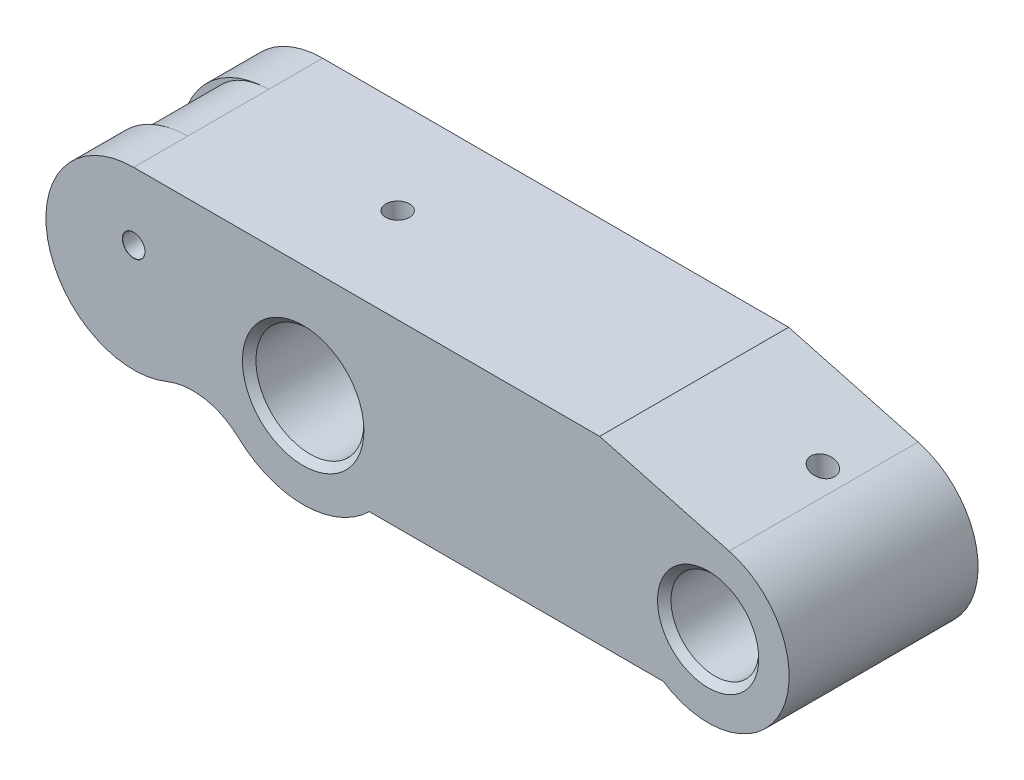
from build123d import *

# Parameters (mm, degrees)
SKETCH_1_R          = 8
SKETCH_1_R_2        = 1.5
SKETCH_1_R_3        = 6.5
EXTRUDE_1_DEPTH     = 14
CHAMFER_1_SIZE      = 1
EXTRUDE_3_DEPTH     = 8
SKETCH_10_R         = 1.75
CUT_EXTRUDE_2_DEPTH = 15
SKETCH_12_R         = 1.75
CUT_EXTRUDE_3_DEPTH = 11


with BuildPart() as part:
    # Sketch 1 → Extrude 1 (new, symmetric)
    with BuildSketch(Plane.XY):
        with BuildLine():
            Line((9.797958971, -10), (53.366750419, -10))
            ThreePointArc((53.366750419, -10), (70.93867824, -4.934097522), (63.105828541, 11.591109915))
            Line((63.105828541, 11.591109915), (43.929860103, 16.729295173))
            Line((43.929860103, 16.729295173), (-25.114071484, 16.729295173))
            ThreePointArc((-25.114071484, 16.729295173), (-35.042317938, 5.533501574), (-22.739644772, -2.984720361))
            ThreePointArc((-22.739644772, -2.984720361), (-16.593377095, -3.43735286), (-11.879710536, -7.407595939))
            ThreePointArc((-11.879710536, -7.407595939), (-1.662396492, -13.900950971), (9.797958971, -10))
        make_face()
        Circle(SKETCH_1_R, mode=Mode.SUBTRACT)
        with Locations((-25.114071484, 6.729295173)):
            Circle(SKETCH_1_R_2, mode=Mode.SUBTRACT)
        with Locations((60, 0)):
            Circle(SKETCH_1_R_3, mode=Mode.SUBTRACT)
    extrude(amount=EXTRUDE_1_DEPTH, both=True)

    # Chamfer 1
    chamfer_1_edges = [part.edges().sort_by_distance(p)[0] for p in [
        (-8, 0, -14),
        (-8, 0, 14),
        (53.5, 0, -14),
        (53.5, 0, 14),
    ]]
    chamfer(chamfer_1_edges, length=CHAMFER_1_SIZE)

    # Sketch 6 → Extrude 3 (add)
    with BuildSketch(Plane.XY.offset(14)):
        with BuildLine():
            ThreePointArc((-22.739644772, -2.984720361), (-35.042317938, 5.533501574), (-25.114071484, 16.729295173))
            ThreePointArc((-25.114071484, 16.729295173), (-37.868009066, 1.211940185), (-20.174657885, -8.295770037))
            ThreePointArc((-20.174657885, -8.295770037), (-18.541123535, -7.783219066), (-16.844100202, -7.556823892))
            ThreePointArc((-16.844100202, -7.556823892), (-12.927432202, -8.158939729), (-9.552147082, -10.235061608))
            ThreePointArc((-9.552147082, -10.235061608), (-10.808782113, -8.897765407), (-11.879710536, -7.407595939))
            ThreePointArc((-11.879710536, -7.407595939), (-16.593377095, -3.43735286), (-22.739644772, -2.984720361))
        make_face()
    extrude_3 = extrude(amount=-EXTRUDE_3_DEPTH)

    # Mirror 3: Extrude 3 across plane
    add(extrude_3.mirror(Plane.XY))

    # Sketch 8 → Hole Wizard M4 _1 (revolve, cut)
    with BuildSketch(Plane(origin=(-25.114071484, 6.729295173, 14), x_dir=(0, -1, 0), z_dir=(1, 0, 0))):
        Polygon((0, 0), (0, 8.991420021), (1.65, 8), (1.65, 0.025), (1.675, 0), align=None)
    hole_wizard_m4_1 = revolve(axis=Axis((-25.114071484, 6.729295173, 20.35), (0, 0, -1)), mode=Mode.SUBTRACT)

    # Mirror 4: Hole Wizard M4 _1 across plane
    add(hole_wizard_m4_1.mirror(Plane.XY), mode=Mode.SUBTRACT)

    # Sketch 10 → Cut-Extrude 2 (cut)
    with BuildSketch(Plane(origin=(0, 16.729295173, 0), x_dir=(1, 0, 0), z_dir=(0, 1, 0))):
        with Locations(Location((0, 0, 0), (0, 0, 270))):
            Circle(SKETCH_10_R)
    extrude(amount=-CUT_EXTRUDE_2_DEPTH, mode=Mode.SUBTRACT)

    # Sketch 12 → Cut-Extrude 3 (cut)
    with BuildSketch(Plane(origin=(0, 16.729295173, 0), x_dir=(1, 0, 0), z_dir=(0, 1, 0))):
        with Locations(Location((60, 3, 0), (0, 0, 270))):
            Circle(SKETCH_12_R)
    extrude(amount=-CUT_EXTRUDE_3_DEPTH, mode=Mode.SUBTRACT)


solid = part.part
